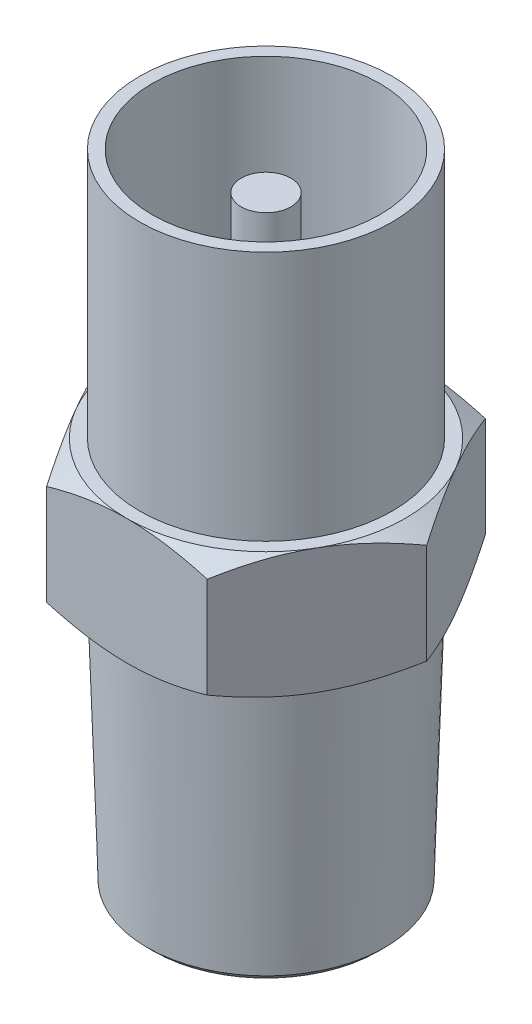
ISO-10303-21;
HEADER;
FILE_DESCRIPTION(('STEP AP214'),'2;1');
FILE_NAME('part.step','',(''),(''),'','','');
FILE_SCHEMA(('AUTOMOTIVE_DESIGN { 1 0 10303 214 1 1 1 1 }'));
ENDSEC;
DATA;
#1=APPLICATION_CONTEXT('core data for automotive mechanical design processes');
#2=APPLICATION_PROTOCOL_DEFINITION('international standard','automotive_design',2000,#1);
#3=PRODUCT_CONTEXT('',#1,'mechanical');
#4=PRODUCT('Part','Part','',(#3));
#5=PRODUCT_RELATED_PRODUCT_CATEGORY('part','',(#4));
#6=PRODUCT_DEFINITION_FORMATION('','',#4);
#7=PRODUCT_DEFINITION_CONTEXT('part definition',#1,'design');
#8=PRODUCT_DEFINITION('design','',#6,#7);
#9=PRODUCT_DEFINITION_SHAPE('','',#8);
#10=(LENGTH_UNIT() NAMED_UNIT(*) SI_UNIT(.MILLI.,.METRE.));
#11=(NAMED_UNIT(*) PLANE_ANGLE_UNIT() SI_UNIT($,.RADIAN.));
#12=(NAMED_UNIT(*) SI_UNIT($,.STERADIAN.) SOLID_ANGLE_UNIT());
#13=UNCERTAINTY_MEASURE_WITH_UNIT(LENGTH_MEASURE(1.E-05),#10,'distance_accuracy_value','');
#14=(GEOMETRIC_REPRESENTATION_CONTEXT(3) GLOBAL_UNCERTAINTY_ASSIGNED_CONTEXT((#13)) GLOBAL_UNIT_ASSIGNED_CONTEXT((#10,
#11,#12)) REPRESENTATION_CONTEXT('',''));
#15=CARTESIAN_POINT('',(0.,0.,0.));
#16=DIRECTION('',(0.,0.,1.));
#17=DIRECTION('',(1.,0.,0.));
#18=AXIS2_PLACEMENT_3D('',#15,#16,#17);
#19=CARTESIAN_POINT('',(0.,2.,0.));
#20=DIRECTION('',(0.,-1.,0.));
#21=DIRECTION('',(0.,0.,-1.));
#22=AXIS2_PLACEMENT_3D('',#19,#20,#21);
#23=CYLINDRICAL_SURFACE('',#22,0.9925);
#24=CARTESIAN_POINT('',(0.,2.,0.));
#25=DIRECTION('',(0.,1.,0.));
#26=DIRECTION('',(0.,0.,1.));
#27=AXIS2_PLACEMENT_3D('',#24,#25,#26);
#28=CIRCLE('',#27,0.9925);
#29=CARTESIAN_POINT('',(0.,2.,0.992499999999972));
#30=VERTEX_POINT('',#29);
#31=EDGE_CURVE('E11',#30,#30,#28,.T.);
#32=ORIENTED_EDGE('',*,*,#31,.F.);
#33=EDGE_LOOP('',(#32));
#34=FACE_BOUND('',#33,.T.);
#35=CARTESIAN_POINT('',(0.,-16.,0.));
#36=DIRECTION('',(0.,1.,0.));
#37=DIRECTION('',(0.,0.,1.));
#38=AXIS2_PLACEMENT_3D('',#35,#36,#37);
#39=CIRCLE('',#38,0.9925);
#40=CARTESIAN_POINT('',(0.,-16.,0.992499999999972));
#41=VERTEX_POINT('',#40);
#42=EDGE_CURVE('E43',#41,#41,#39,.T.);
#43=ORIENTED_EDGE('',*,*,#42,.T.);
#44=EDGE_LOOP('',(#43));
#45=FACE_BOUND('',#44,.T.);
#46=ADVANCED_FACE('F37',(#34,#45),#23,.T.);
#47=CARTESIAN_POINT('',(0.,2.,0.));
#48=DIRECTION('',(0.,1.,0.));
#49=DIRECTION('',(0.,0.,1.));
#50=AXIS2_PLACEMENT_3D('',#47,#48,#49);
#51=PLANE('',#50);
#52=ORIENTED_EDGE('',*,*,#31,.T.);
#53=EDGE_LOOP('',(#52));
#54=FACE_BOUND('',#53,.T.);
#55=ADVANCED_FACE('F52',(#54),#51,.T.);
#56=CARTESIAN_POINT('',(0.,-16.,0.));
#57=DIRECTION('',(0.,1.,0.));
#58=DIRECTION('',(0.,0.,1.));
#59=AXIS2_PLACEMENT_3D('',#56,#57,#58);
#60=PLANE('',#59);
#61=ORIENTED_EDGE('',*,*,#42,.F.);
#62=EDGE_LOOP('',(#61));
#63=FACE_BOUND('',#62,.T.);
#64=ADVANCED_FACE('F50',(#63),#60,.F.);
#65=CLOSED_SHELL('',(#46,#55,#64));
#66=MANIFOLD_SOLID_BREP('B2',#65);
#67=CARTESIAN_POINT('',(6.41436149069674,-6.50000000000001,0.));
#68=DIRECTION('',(0.,-1.,0.));
#69=DIRECTION('',(0.,0.,-1.));
#70=AXIS2_PLACEMENT_3D('',#67,#68,#69);
#71=PLANE('',#70);
#72=CARTESIAN_POINT('',(0.,-6.50000000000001,0.));
#73=DIRECTION('',(0.,-1.,0.));
#74=DIRECTION('',(0.,0.,-1.));
#75=AXIS2_PLACEMENT_3D('',#72,#73,#74);
#76=CIRCLE('',#75,5.555);
#77=CARTESIAN_POINT('',(4.81077111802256,-6.50000000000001,-2.77750000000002));
#78=VERTEX_POINT('',#77);
#79=CARTESIAN_POINT('',(0.,-6.50000000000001,-5.55500000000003));
#80=VERTEX_POINT('',#79);
#81=EDGE_CURVE('E401',#78,#80,#76,.F.);
#82=ORIENTED_EDGE('',*,*,#81,.T.);
#83=CARTESIAN_POINT('',(-4.81077111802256,-6.50000000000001,-2.77750000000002));
#84=VERTEX_POINT('',#83);
#85=EDGE_CURVE('E398',#80,#84,#76,.F.);
#86=ORIENTED_EDGE('',*,*,#85,.T.);
#87=CARTESIAN_POINT('',(-4.81077111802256,-6.50000000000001,2.77749999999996));
#88=VERTEX_POINT('',#87);
#89=EDGE_CURVE('E400',#84,#88,#76,.F.);
#90=ORIENTED_EDGE('',*,*,#89,.T.);
#91=CARTESIAN_POINT('',(0.,-6.50000000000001,5.55499999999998));
#92=VERTEX_POINT('',#91);
#93=EDGE_CURVE('E405',#88,#92,#76,.F.);
#94=ORIENTED_EDGE('',*,*,#93,.T.);
#95=CARTESIAN_POINT('',(0.,-6.50000000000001,0.));
#96=DIRECTION('',(0.,1.,0.));
#97=DIRECTION('',(0.,0.,1.));
#98=AXIS2_PLACEMENT_3D('',#95,#96,#97);
#99=CIRCLE('',#98,5.555);
#100=CARTESIAN_POINT('',(4.81077111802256,-6.50000000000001,2.77749999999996));
#101=VERTEX_POINT('',#100);
#102=EDGE_CURVE('E434',#92,#101,#99,.T.);
#103=ORIENTED_EDGE('',*,*,#102,.T.);
#104=EDGE_CURVE('E407',#101,#78,#76,.F.);
#105=ORIENTED_EDGE('',*,*,#104,.T.);
#106=EDGE_LOOP('',(#82,#86,#90,#94,#103,#105));
#107=FACE_BOUND('',#106,.T.);
#108=CARTESIAN_POINT('',(0.,-6.50000000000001,0.));
#109=DIRECTION('',(0.,-1.,0.));
#110=DIRECTION('',(0.,0.,-1.));
#111=AXIS2_PLACEMENT_3D('',#108,#109,#110);
#112=CIRCLE('',#111,5.04394385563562);
#113=CARTESIAN_POINT('',(0.,-6.50000000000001,-5.04394385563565));
#114=VERTEX_POINT('',#113);
#115=EDGE_CURVE('E35',#114,#114,#112,.F.);
#116=ORIENTED_EDGE('',*,*,#115,.F.);
#117=EDGE_LOOP('',(#116));
#118=FACE_BOUND('',#117,.T.);
#119=ADVANCED_FACE('F72',(#107,#118),#71,.F.);
#120=CARTESIAN_POINT('',(0.,-21.6144278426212,0.));
#121=DIRECTION('',(0.,1.,0.));
#122=DIRECTION('',(0.,0.,1.));
#123=AXIS2_PLACEMENT_3D('',#120,#121,#122);
#124=CYLINDRICAL_SURFACE('',#123,1.985);
#125=CARTESIAN_POINT('',(0.,-16.,0.));
#126=DIRECTION('',(0.,1.,0.));
#127=DIRECTION('',(0.,0.,1.));
#128=AXIS2_PLACEMENT_3D('',#125,#126,#127);
#129=CIRCLE('',#128,1.985);
#130=CARTESIAN_POINT('',(0.,-16.,1.98499999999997));
#131=VERTEX_POINT('',#130);
#132=EDGE_CURVE('E333',#131,#131,#129,.F.);
#133=ORIENTED_EDGE('',*,*,#132,.T.);
#134=EDGE_LOOP('',(#133));
#135=FACE_BOUND('',#134,.T.);
#136=CARTESIAN_POINT('',(0.,-6.50000000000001,0.));
#137=DIRECTION('',(0.,-1.,0.));
#138=DIRECTION('',(0.,0.,-1.));
#139=AXIS2_PLACEMENT_3D('',#136,#137,#138);
#140=CIRCLE('',#139,1.985);
#141=CARTESIAN_POINT('',(0.,-6.50000000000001,-1.98500000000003));
#142=VERTEX_POINT('',#141);
#143=EDGE_CURVE('E346',#142,#142,#140,.F.);
#144=ORIENTED_EDGE('',*,*,#143,.T.);
#145=EDGE_LOOP('',(#144));
#146=FACE_BOUND('',#145,.T.);
#147=ADVANCED_FACE('F310',(#135,#146),#124,.F.);
#148=CARTESIAN_POINT('',(0.,-6.99615258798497,0.));
#149=DIRECTION('',(0.,-1.,0.));
#150=DIRECTION('',(0.,0.,-1.));
#151=AXIS2_PLACEMENT_3D('',#148,#149,#150);
#152=CONICAL_SURFACE('',#151,6.41436149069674,1.0471975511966);
#153=CARTESIAN_POINT('',(6.41447696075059,-6.99621925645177,0.000199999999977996));
#154=CARTESIAN_POINT('',(6.34397930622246,-6.95552307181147,-0.12190551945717));
#155=CARTESIAN_POINT('',(6.27321880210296,-6.91667379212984,-0.244466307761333));
#156=CARTESIAN_POINT('',(6.13112314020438,-6.84317772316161,-0.490583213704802));
#157=CARTESIAN_POINT('',(6.05978774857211,-6.80853274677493,-0.614139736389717));
#158=CARTESIAN_POINT('',(5.84463938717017,-6.71158428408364,-0.986787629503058));
#159=CARTESIAN_POINT('',(5.69997714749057,-6.65644086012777,-1.23734997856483));
#160=CARTESIAN_POINT('',(5.48349273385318,-6.59177825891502,-1.61231198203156));
#161=CARTESIAN_POINT('',(5.41231740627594,-6.57335766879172,-1.73559126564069));
#162=CARTESIAN_POINT('',(5.26964513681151,-6.54246881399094,-1.98270688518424));
#163=CARTESIAN_POINT('',(5.19814822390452,-6.53000002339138,-2.10654317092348));
#164=CARTESIAN_POINT('',(5.05503021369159,-6.5113325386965,-2.35443083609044));
#165=CARTESIAN_POINT('',(4.98340935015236,-6.50512672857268,-2.47848181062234));
#166=CARTESIAN_POINT('',(4.84010540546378,-6.499111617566,-2.72669152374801));
#167=CARTESIAN_POINT('',(4.76842232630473,-6.4993021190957,-2.85085025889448));
#168=CARTESIAN_POINT('',(4.57203130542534,-6.50861630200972,-3.19100948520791));
#169=CARTESIAN_POINT('',(4.44738764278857,-6.52425419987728,-3.40689864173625));
#170=CARTESIAN_POINT('',(4.19892819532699,-6.57384328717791,-3.83724302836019));
#171=CARTESIAN_POINT('',(4.07511328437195,-6.60781142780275,-4.05169674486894));
#172=CARTESIAN_POINT('',(3.82615376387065,-6.69272238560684,-4.48290728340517));
#173=CARTESIAN_POINT('',(3.70104057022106,-6.74402498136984,-4.69960969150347));
#174=CARTESIAN_POINT('',(3.45268003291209,-6.86046135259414,-5.12978276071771));
#175=CARTESIAN_POINT('',(3.32942950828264,-6.92556777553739,-5.34325893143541));
#176=CARTESIAN_POINT('',(3.20706527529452,-6.99621925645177,-5.55520000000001));
#177=B_SPLINE_CURVE_WITH_KNOTS('',3,(#153,#154,#155,#156,#157,#158,#159,#160,#161,#162,#163,
#164,#165,#166,#167,#168,#169,#170,#171,#172,#173,#174,#175,#176),.UNSPECIFIED.,.F.,.F.,(4,2,2,
2,2,2,2,2,2,2,2,4),(0.,0.44021785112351,0.880624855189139,1.76326895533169,2.19378108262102,
2.62425516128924,3.05423958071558,3.48421071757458,4.23275721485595,4.98199713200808,
5.7478547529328,6.51220876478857),.UNSPECIFIED.);
#178=CARTESIAN_POINT('',(3.20718074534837,-6.99615258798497,-5.555));
#179=VERTEX_POINT('',#178);
#180=EDGE_CURVE('E264',#78,#179,#177,.T.);
#181=ORIENTED_EDGE('',*,*,#180,.T.);
#182=CARTESIAN_POINT('',(-8.50591597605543,-9.15821584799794,-5.55500000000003));
#183=CARTESIAN_POINT('',(-8.26202006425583,-9.04035187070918,-5.55500000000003));
#184=CARTESIAN_POINT('',(-8.01754750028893,-8.92365955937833,-5.55500000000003));
#185=CARTESIAN_POINT('',(-7.52713727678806,-8.69328779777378,-5.55500000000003));
#186=CARTESIAN_POINT('',(-7.2811993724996,-8.57960886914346,-5.55500000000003));
#187=CARTESIAN_POINT('',(-6.78621814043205,-8.35533453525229,-5.55500000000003));
#188=CARTESIAN_POINT('',(-6.53716509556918,-8.24476049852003,-5.55500000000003));
#189=CARTESIAN_POINT('',(-6.03701199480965,-8.02836185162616,-5.55500000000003));
#190=CARTESIAN_POINT('',(-5.78591204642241,-7.92253699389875,-5.55500000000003));
#191=CARTESIAN_POINT('',(-5.27814862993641,-7.71564321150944,-5.55500000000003));
#192=CARTESIAN_POINT('',(-5.02145470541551,-7.61464862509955,-5.55500000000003));
#193=CARTESIAN_POINT('',(-4.5050389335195,-7.42056938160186,-5.55500000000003));
#194=CARTESIAN_POINT('',(-4.24531675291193,-7.3274856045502,-5.55500000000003));
#195=CARTESIAN_POINT('',(-3.72296562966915,-7.15172885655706,-5.55500000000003));
#196=CARTESIAN_POINT('',(-3.46034420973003,-7.06903375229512,-5.55500000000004));
#197=CARTESIAN_POINT('',(-2.93136514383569,-6.91674098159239,-5.55500000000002));
#198=CARTESIAN_POINT('',(-2.66500870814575,-6.84713917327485,-5.555));
#199=CARTESIAN_POINT('',(-2.12839051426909,-6.72440839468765,-5.555));
#200=CARTESIAN_POINT('',(-1.85812773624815,-6.67128381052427,-5.55500000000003));
#201=CARTESIAN_POINT('',(-1.31430588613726,-6.58509766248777,-5.55500000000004));
#202=CARTESIAN_POINT('',(-1.04074681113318,-6.55203611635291,-5.55500000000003));
#203=CARTESIAN_POINT('',(-0.629972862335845,-6.51961048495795,-5.55500000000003));
#204=CARTESIAN_POINT('',(-0.493400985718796,-6.51166141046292,-5.55500000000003));
#205=CARTESIAN_POINT('',(-0.220036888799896,-6.50155034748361,-5.55500000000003));
#206=CARTESIAN_POINT('',(-0.0832446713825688,-6.49938828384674,-5.55500000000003));
#207=CARTESIAN_POINT('',(0.190267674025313,-6.50090932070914,-5.55500000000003));
#208=CARTESIAN_POINT('',(0.326987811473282,-6.50459078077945,-5.55500000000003));
#209=CARTESIAN_POINT('',(0.600154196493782,-6.51770556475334,-5.55500000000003));
#210=CARTESIAN_POINT('',(0.736600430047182,-6.5271391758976,-5.55500000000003));
#211=CARTESIAN_POINT('',(1.06730397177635,-6.55677796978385,-5.55500000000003));
#212=CARTESIAN_POINT('',(1.26130714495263,-6.57986541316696,-5.55500000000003));
#213=CARTESIAN_POINT('',(1.64782691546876,-6.63638797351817,-5.55500000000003));
#214=CARTESIAN_POINT('',(1.84034309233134,-6.66982591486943,-5.55500000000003));
#215=CARTESIAN_POINT('',(2.22372997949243,-6.74586359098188,-5.55500000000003));
#216=CARTESIAN_POINT('',(2.41459895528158,-6.78847198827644,-5.55500000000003));
#217=CARTESIAN_POINT('',(2.79437314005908,-6.88155052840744,-5.55500000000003));
#218=CARTESIAN_POINT('',(2.9832785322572,-6.93201993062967,-5.55500000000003));
#219=CARTESIAN_POINT('',(3.36377824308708,-7.04093232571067,-5.55500000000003));
#220=CARTESIAN_POINT('',(3.55532497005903,-7.0995404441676,-5.55500000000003));
#221=CARTESIAN_POINT('',(3.93639377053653,-7.22254750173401,-5.55500000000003));
#222=CARTESIAN_POINT('',(4.12591714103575,-7.28694244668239,-5.55500000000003));
#223=CARTESIAN_POINT('',(4.50217874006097,-7.42019301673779,-5.55500000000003));
#224=CARTESIAN_POINT('',(4.68892664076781,-7.48902149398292,-5.55500000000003));
#225=CARTESIAN_POINT('',(5.06097353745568,-7.63071828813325,-5.55500000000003));
#226=CARTESIAN_POINT('',(5.24627191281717,-7.70358823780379,-5.55500000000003));
#227=CARTESIAN_POINT('',(5.43089711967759,-7.77807913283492,-5.55500000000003));
#228=B_SPLINE_CURVE_WITH_KNOTS('',3,(#182,#183,#184,#185,#186,#187,#188,#189,#190,#191,#192,
#193,#194,#195,#196,#197,#198,#199,#200,#201,#202,#203,#204,#205,#206,#207,#208,#209,#210,#211,
#212,#213,#214,#215,#216,#217,#218,#219,#220,#221,#222,#223,#224,#225,#226,#227),.UNSPECIFIED.,
.F.,.F.,(4,2,2,2,2,2,2,2,2,2,2,2,2,2,2,2,2,2,2,2,2,2,4),(0.,0.812657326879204,1.62545442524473,
2.44290283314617,3.26030857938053,4.08774953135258,4.91528241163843,5.74102118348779,
6.56649830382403,7.39219497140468,8.21789236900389,8.6281972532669,9.03849680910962,
9.44868120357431,9.85888608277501,10.4446760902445,11.0306260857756,11.617132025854,
12.2035827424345,12.8044086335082,13.4048229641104,14.0018577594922,14.5991355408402),.UNSPECIFIED.);
#229=EDGE_CURVE('E265',#179,#80,#228,.F.);
#230=ORIENTED_EDGE('',*,*,#229,.T.);
#231=ORIENTED_EDGE('',*,*,#81,.F.);
#232=EDGE_LOOP('',(#181,#230,#231));
#233=FACE_BOUND('',#232,.T.);
#234=ADVANCED_FACE('F315',(#233),#152,.T.);
#235=CARTESIAN_POINT('',(3.20706527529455,-6.99621925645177,5.55520000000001));
#236=CARTESIAN_POINT('',(3.27756292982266,-6.95552307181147,5.43309448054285));
#237=CARTESIAN_POINT('',(3.34832343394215,-6.91667379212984,5.31053369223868));
#238=CARTESIAN_POINT('',(3.49041909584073,-6.84317772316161,5.06441678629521));
#239=CARTESIAN_POINT('',(3.561754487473,-6.80853274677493,4.94086026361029));
#240=CARTESIAN_POINT('',(3.77690284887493,-6.71158428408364,4.56821237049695));
#241=CARTESIAN_POINT('',(3.92156508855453,-6.65644086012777,4.31765002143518));
#242=CARTESIAN_POINT('',(4.13804950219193,-6.59177825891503,3.94268801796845));
#243=CARTESIAN_POINT('',(4.20922482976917,-6.57335766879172,3.81940873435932));
#244=CARTESIAN_POINT('',(4.35189709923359,-6.54246881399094,3.57229311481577));
#245=CARTESIAN_POINT('',(4.42339401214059,-6.53000002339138,3.44845682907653));
#246=CARTESIAN_POINT('',(4.56651202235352,-6.5113325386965,3.20056916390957));
#247=CARTESIAN_POINT('',(4.63813288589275,-6.50512672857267,3.07651818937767));
#248=CARTESIAN_POINT('',(4.78143683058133,-6.49911161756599,2.828308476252));
#249=CARTESIAN_POINT('',(4.85311990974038,-6.4993021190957,2.70414974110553));
#250=CARTESIAN_POINT('',(5.04951093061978,-6.50861630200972,2.36399051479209));
#251=CARTESIAN_POINT('',(5.17415459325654,-6.52425419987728,2.14810135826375));
#252=CARTESIAN_POINT('',(5.42261404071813,-6.57384328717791,1.71775697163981));
#253=CARTESIAN_POINT('',(5.54642895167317,-6.60781142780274,1.50330325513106));
#254=CARTESIAN_POINT('',(5.79538847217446,-6.69272238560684,1.07209271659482));
#255=CARTESIAN_POINT('',(5.92050166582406,-6.74402498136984,0.855390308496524));
#256=CARTESIAN_POINT('',(6.16886220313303,-6.86046135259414,0.425217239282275));
#257=CARTESIAN_POINT('',(6.29211272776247,-6.9255677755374,0.211741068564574));
#258=CARTESIAN_POINT('',(6.41447696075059,-6.99621925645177,-0.000200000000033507));
#259=B_SPLINE_CURVE_WITH_KNOTS('',3,(#235,#236,#237,#238,#239,#240,#241,#242,#243,#244,#245,
#246,#247,#248,#249,#250,#251,#252,#253,#254,#255,#256,#257,#258),.UNSPECIFIED.,.F.,.F.,(4,2,2,
2,2,2,2,2,2,2,2,4),(0.,0.440217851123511,0.880624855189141,1.76326895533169,2.19378108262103,
2.62425516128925,3.05423958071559,3.48421071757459,4.23275721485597,4.9819971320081,
5.74785475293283,6.5122087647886),.UNSPECIFIED.);
#260=CARTESIAN_POINT('',(6.41436149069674,-6.99615258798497,0.));
#261=VERTEX_POINT('',#260);
#262=EDGE_CURVE('E282',#101,#261,#259,.T.);
#263=ORIENTED_EDGE('',*,*,#262,.T.);
#264=EDGE_CURVE('E276',#261,#78,#177,.T.);
#265=ORIENTED_EDGE('',*,*,#264,.T.);
#266=ORIENTED_EDGE('',*,*,#104,.F.);
#267=EDGE_LOOP('',(#263,#265,#266));
#268=FACE_BOUND('',#267,.T.);
#269=ADVANCED_FACE('F466',(#268),#152,.T.);
#270=CARTESIAN_POINT('',(-8.50591597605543,-9.15821584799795,5.55499999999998));
#271=CARTESIAN_POINT('',(-8.26202006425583,-9.04035187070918,5.55499999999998));
#272=CARTESIAN_POINT('',(-8.01754750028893,-8.92365955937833,5.55499999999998));
#273=CARTESIAN_POINT('',(-7.52713727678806,-8.69328779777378,5.55499999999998));
#274=CARTESIAN_POINT('',(-7.2811993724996,-8.57960886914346,5.55499999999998));
#275=CARTESIAN_POINT('',(-6.78621814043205,-8.35533453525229,5.55499999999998));
#276=CARTESIAN_POINT('',(-6.53716509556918,-8.24476049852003,5.55499999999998));
#277=CARTESIAN_POINT('',(-6.03701199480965,-8.02836185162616,5.55499999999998));
#278=CARTESIAN_POINT('',(-5.78591204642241,-7.92253699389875,5.55499999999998));
#279=CARTESIAN_POINT('',(-5.27814862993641,-7.71564321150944,5.55499999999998));
#280=CARTESIAN_POINT('',(-5.02145470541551,-7.61464862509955,5.55499999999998));
#281=CARTESIAN_POINT('',(-4.5050389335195,-7.42056938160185,5.55499999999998));
#282=CARTESIAN_POINT('',(-4.24531675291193,-7.32748560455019,5.55499999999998));
#283=CARTESIAN_POINT('',(-3.72296562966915,-7.15172885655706,5.55499999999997));
#284=CARTESIAN_POINT('',(-3.46034420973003,-7.06903375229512,5.55499999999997));
#285=CARTESIAN_POINT('',(-2.93136514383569,-6.91674098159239,5.55499999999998));
#286=CARTESIAN_POINT('',(-2.66500870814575,-6.84713917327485,5.555));
#287=CARTESIAN_POINT('',(-2.12839051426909,-6.72440839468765,5.555));
#288=CARTESIAN_POINT('',(-1.85812773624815,-6.67128381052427,5.55499999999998));
#289=CARTESIAN_POINT('',(-1.31430588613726,-6.58509766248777,5.55499999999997));
#290=CARTESIAN_POINT('',(-1.04074681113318,-6.55203611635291,5.55499999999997));
#291=CARTESIAN_POINT('',(-0.629972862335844,-6.51961048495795,5.55499999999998));
#292=CARTESIAN_POINT('',(-0.493400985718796,-6.51166141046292,5.55499999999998));
#293=CARTESIAN_POINT('',(-0.220036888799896,-6.50155034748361,5.55499999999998));
#294=CARTESIAN_POINT('',(-0.0832446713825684,-6.49938828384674,5.55499999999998));
#295=CARTESIAN_POINT('',(0.190267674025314,-6.50090932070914,5.55499999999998));
#296=CARTESIAN_POINT('',(0.326987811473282,-6.50459078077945,5.55499999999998));
#297=CARTESIAN_POINT('',(0.600154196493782,-6.51770556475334,5.55499999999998));
#298=CARTESIAN_POINT('',(0.736600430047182,-6.5271391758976,5.55499999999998));
#299=CARTESIAN_POINT('',(1.06730397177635,-6.55677796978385,5.55499999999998));
#300=CARTESIAN_POINT('',(1.26130714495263,-6.57986541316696,5.55499999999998));
#301=CARTESIAN_POINT('',(1.64782691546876,-6.63638797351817,5.55499999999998));
#302=CARTESIAN_POINT('',(1.84034309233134,-6.66982591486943,5.55499999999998));
#303=CARTESIAN_POINT('',(2.22372997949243,-6.74586359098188,5.55499999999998));
#304=CARTESIAN_POINT('',(2.41459895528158,-6.78847198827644,5.55499999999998));
#305=CARTESIAN_POINT('',(2.79437314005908,-6.88155052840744,5.55499999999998));
#306=CARTESIAN_POINT('',(2.9832785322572,-6.93201993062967,5.55499999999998));
#307=CARTESIAN_POINT('',(3.36377824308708,-7.04093232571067,5.55499999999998));
#308=CARTESIAN_POINT('',(3.55532497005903,-7.0995404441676,5.55499999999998));
#309=CARTESIAN_POINT('',(3.93639377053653,-7.22254750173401,5.55499999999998));
#310=CARTESIAN_POINT('',(4.12591714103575,-7.28694244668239,5.55499999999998));
#311=CARTESIAN_POINT('',(4.50217874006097,-7.42019301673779,5.55499999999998));
#312=CARTESIAN_POINT('',(4.68892664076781,-7.48902149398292,5.55499999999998));
#313=CARTESIAN_POINT('',(5.06097353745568,-7.63071828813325,5.55499999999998));
#314=CARTESIAN_POINT('',(5.24627191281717,-7.70358823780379,5.55499999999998));
#315=CARTESIAN_POINT('',(5.43089711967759,-7.77807913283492,5.55499999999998));
#316=B_SPLINE_CURVE_WITH_KNOTS('',3,(#270,#271,#272,#273,#274,#275,#276,#277,#278,#279,#280,
#281,#282,#283,#284,#285,#286,#287,#288,#289,#290,#291,#292,#293,#294,#295,#296,#297,#298,#299,
#300,#301,#302,#303,#304,#305,#306,#307,#308,#309,#310,#311,#312,#313,#314,#315),.UNSPECIFIED.,
.F.,.F.,(4,2,2,2,2,2,2,2,2,2,2,2,2,2,2,2,2,2,2,2,2,2,4),(0.,0.812657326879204,1.62545442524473,
2.44290283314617,3.26030857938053,4.08774953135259,4.91528241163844,5.74102118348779,
6.56649830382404,7.39219497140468,8.21789236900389,8.6281972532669,9.03849680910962,
9.44868120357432,9.85888608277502,10.4446760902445,11.0306260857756,11.617132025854,
12.2035827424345,12.8044086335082,13.4048229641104,14.0018577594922,14.5991355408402),.UNSPECIFIED.);
#317=CARTESIAN_POINT('',(3.20718074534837,-6.99615258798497,5.555));
#318=VERTEX_POINT('',#317);
#319=EDGE_CURVE('E290',#92,#318,#316,.T.);
#320=ORIENTED_EDGE('',*,*,#319,.T.);
#321=EDGE_CURVE('E289',#318,#101,#259,.T.);
#322=ORIENTED_EDGE('',*,*,#321,.T.);
#323=ORIENTED_EDGE('',*,*,#102,.F.);
#324=EDGE_LOOP('',(#320,#322,#323));
#325=FACE_BOUND('',#324,.T.);
#326=ADVANCED_FACE('F435',(#325),#152,.T.);
#327=CARTESIAN_POINT('',(-3.20718074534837,-6.99615258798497,5.55499999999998));
#328=VERTEX_POINT('',#327);
#329=EDGE_CURVE('E296',#328,#92,#316,.T.);
#330=ORIENTED_EDGE('',*,*,#329,.T.);
#331=ORIENTED_EDGE('',*,*,#93,.F.);
#332=CARTESIAN_POINT('',(-6.41447696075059,-6.99621925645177,-0.000200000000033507));
#333=CARTESIAN_POINT('',(-6.34397930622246,-6.95552307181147,0.121905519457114));
#334=CARTESIAN_POINT('',(-6.27321880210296,-6.91667379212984,0.244466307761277));
#335=CARTESIAN_POINT('',(-6.13112314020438,-6.84317772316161,0.490583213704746));
#336=CARTESIAN_POINT('',(-6.05978774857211,-6.80853274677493,0.614139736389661));
#337=CARTESIAN_POINT('',(-5.84463938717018,-6.71158428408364,0.986787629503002));
#338=CARTESIAN_POINT('',(-5.69997714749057,-6.65644086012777,1.23734997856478));
#339=CARTESIAN_POINT('',(-5.48349273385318,-6.59177825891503,1.6123119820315));
#340=CARTESIAN_POINT('',(-5.41231740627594,-6.57335766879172,1.73559126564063));
#341=CARTESIAN_POINT('',(-5.26964513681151,-6.54246881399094,1.98270688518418));
#342=CARTESIAN_POINT('',(-5.19814822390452,-6.53000002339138,2.10654317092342));
#343=CARTESIAN_POINT('',(-5.05503021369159,-6.51133253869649,2.35443083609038));
#344=CARTESIAN_POINT('',(-4.98340935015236,-6.50512672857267,2.47848181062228));
#345=CARTESIAN_POINT('',(-4.84010540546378,-6.49911161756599,2.72669152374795));
#346=CARTESIAN_POINT('',(-4.76842232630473,-6.4993021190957,2.85085025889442));
#347=CARTESIAN_POINT('',(-4.57203130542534,-6.50861630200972,3.19100948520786));
#348=CARTESIAN_POINT('',(-4.44738764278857,-6.52425419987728,3.40689864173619));
#349=CARTESIAN_POINT('',(-4.19892819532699,-6.57384328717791,3.83724302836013));
#350=CARTESIAN_POINT('',(-4.07511328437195,-6.60781142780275,4.05169674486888));
#351=CARTESIAN_POINT('',(-3.82615376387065,-6.69272238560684,4.48290728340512));
#352=CARTESIAN_POINT('',(-3.70104057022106,-6.74402498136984,4.69960969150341));
#353=CARTESIAN_POINT('',(-3.45268003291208,-6.86046135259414,5.12978276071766));
#354=CARTESIAN_POINT('',(-3.32942950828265,-6.9255677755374,5.34325893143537));
#355=CARTESIAN_POINT('',(-3.20706527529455,-6.99621925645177,5.55519999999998));
#356=B_SPLINE_CURVE_WITH_KNOTS('',3,(#332,#333,#334,#335,#336,#337,#338,#339,#340,#341,#342,
#343,#344,#345,#346,#347,#348,#349,#350,#351,#352,#353,#354,#355),.UNSPECIFIED.,.F.,.F.,(4,2,2,
2,2,2,2,2,2,2,2,4),(0.,0.440217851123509,0.880624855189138,1.76326895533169,2.19378108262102,
2.62425516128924,3.05423958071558,3.48421071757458,4.23275721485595,4.98199713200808,
5.74785475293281,6.51220876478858),.UNSPECIFIED.);
#357=EDGE_CURVE('E283',#88,#328,#356,.T.);
#358=ORIENTED_EDGE('',*,*,#357,.T.);
#359=EDGE_LOOP('',(#330,#331,#358));
#360=FACE_BOUND('',#359,.T.);
#361=ADVANCED_FACE('F428',(#360),#152,.T.);
#362=CARTESIAN_POINT('',(-6.41436149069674,-6.99615258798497,0.));
#363=VERTEX_POINT('',#362);
#364=EDGE_CURVE('E277',#363,#88,#356,.T.);
#365=ORIENTED_EDGE('',*,*,#364,.T.);
#366=ORIENTED_EDGE('',*,*,#89,.F.);
#367=CARTESIAN_POINT('',(-3.20706527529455,-6.99621925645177,-5.55520000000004));
#368=CARTESIAN_POINT('',(-3.27756292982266,-6.95552307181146,-5.43309448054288));
#369=CARTESIAN_POINT('',(-3.34832343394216,-6.91667379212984,-5.31053369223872));
#370=CARTESIAN_POINT('',(-3.49041909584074,-6.84317772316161,-5.06441678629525));
#371=CARTESIAN_POINT('',(-3.56175448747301,-6.80853274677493,-4.94086026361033));
#372=CARTESIAN_POINT('',(-3.77690284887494,-6.71158428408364,-4.56821237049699));
#373=CARTESIAN_POINT('',(-3.92156508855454,-6.65644086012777,-4.31765002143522));
#374=CARTESIAN_POINT('',(-4.13804950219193,-6.59177825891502,-3.9426880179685));
#375=CARTESIAN_POINT('',(-4.20922482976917,-6.57335766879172,-3.81940873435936));
#376=CARTESIAN_POINT('',(-4.3518970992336,-6.54246881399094,-3.57229311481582));
#377=CARTESIAN_POINT('',(-4.42339401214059,-6.53000002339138,-3.44845682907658));
#378=CARTESIAN_POINT('',(-4.56651202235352,-6.51133253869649,-3.20056916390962));
#379=CARTESIAN_POINT('',(-4.63813288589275,-6.50512672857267,-3.07651818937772));
#380=CARTESIAN_POINT('',(-4.78143683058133,-6.49911161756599,-2.82830847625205));
#381=CARTESIAN_POINT('',(-4.85311990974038,-6.4993021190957,-2.70414974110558));
#382=CARTESIAN_POINT('',(-5.04951093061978,-6.50861630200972,-2.36399051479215));
#383=CARTESIAN_POINT('',(-5.17415459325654,-6.52425419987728,-2.14810135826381));
#384=CARTESIAN_POINT('',(-5.42261404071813,-6.57384328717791,-1.71775697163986));
#385=CARTESIAN_POINT('',(-5.54642895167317,-6.60781142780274,-1.50330325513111));
#386=CARTESIAN_POINT('',(-5.79538847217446,-6.69272238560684,-1.07209271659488));
#387=CARTESIAN_POINT('',(-5.92050166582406,-6.74402498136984,-0.855390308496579));
#388=CARTESIAN_POINT('',(-6.16886220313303,-6.86046135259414,-0.42521723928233));
#389=CARTESIAN_POINT('',(-6.29211272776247,-6.9255677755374,-0.211741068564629));
#390=CARTESIAN_POINT('',(-6.41447696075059,-6.99621925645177,0.000199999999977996));
#391=B_SPLINE_CURVE_WITH_KNOTS('',3,(#367,#368,#369,#370,#371,#372,#373,#374,#375,#376,#377,
#378,#379,#380,#381,#382,#383,#384,#385,#386,#387,#388,#389,#390),.UNSPECIFIED.,.F.,.F.,(4,2,2,
2,2,2,2,2,2,2,2,4),(0.,0.440217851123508,0.880624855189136,1.76326895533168,2.19378108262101,
2.62425516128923,3.05423958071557,3.48421071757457,4.23275721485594,4.98199713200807,
5.74785475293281,6.51220876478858),.UNSPECIFIED.);
#392=EDGE_CURVE('E266',#84,#363,#391,.T.);
#393=ORIENTED_EDGE('',*,*,#392,.T.);
#394=EDGE_LOOP('',(#365,#366,#393));
#395=FACE_BOUND('',#394,.T.);
#396=ADVANCED_FACE('F461',(#395),#152,.T.);
#397=CARTESIAN_POINT('',(-3.20718074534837,-6.99615258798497,-5.55500000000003));
#398=VERTEX_POINT('',#397);
#399=EDGE_CURVE('E258',#398,#84,#391,.T.);
#400=ORIENTED_EDGE('',*,*,#399,.T.);
#401=ORIENTED_EDGE('',*,*,#85,.F.);
#402=EDGE_CURVE('E267',#80,#398,#228,.F.);
#403=ORIENTED_EDGE('',*,*,#402,.T.);
#404=EDGE_LOOP('',(#400,#401,#403));
#405=FACE_BOUND('',#404,.T.);
#406=ADVANCED_FACE('F217',(#405),#152,.T.);
#407=CARTESIAN_POINT('',(3.20718074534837,-28.4708053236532,-5.55500000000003));
#408=DIRECTION('',(0.,0.,-1.));
#409=DIRECTION('',(-1.,0.,0.));
#410=AXIS2_PLACEMENT_3D('',#407,#408,#409);
#411=PLANE('',#410);
#412=CARTESIAN_POINT('',(-8.50591597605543,-8.84178415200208,-5.55500000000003));
#413=CARTESIAN_POINT('',(-8.26202006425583,-8.95964812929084,-5.55500000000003));
#414=CARTESIAN_POINT('',(-8.01754750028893,-9.07634044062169,-5.55500000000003));
#415=CARTESIAN_POINT('',(-7.52713727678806,-9.30671220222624,-5.55500000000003));
#416=CARTESIAN_POINT('',(-7.2811993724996,-9.42039113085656,-5.55500000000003));
#417=CARTESIAN_POINT('',(-6.78621814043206,-9.64466546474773,-5.55500000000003));
#418=CARTESIAN_POINT('',(-6.53716509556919,-9.75523950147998,-5.55500000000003));
#419=CARTESIAN_POINT('',(-6.03701199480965,-9.97163814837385,-5.55500000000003));
#420=CARTESIAN_POINT('',(-5.78591204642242,-10.0774630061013,-5.55500000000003));
#421=CARTESIAN_POINT('',(-5.27814862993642,-10.2843567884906,-5.55500000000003));
#422=CARTESIAN_POINT('',(-5.02145470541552,-10.3853513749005,-5.55500000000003));
#423=CARTESIAN_POINT('',(-4.50503893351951,-10.5794306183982,-5.55500000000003));
#424=CARTESIAN_POINT('',(-4.24531675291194,-10.6725143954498,-5.55500000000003));
#425=CARTESIAN_POINT('',(-3.72296562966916,-10.848271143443,-5.55500000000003));
#426=CARTESIAN_POINT('',(-3.46034420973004,-10.9309662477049,-5.55500000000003));
#427=CARTESIAN_POINT('',(-2.93136514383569,-11.0832590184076,-5.55500000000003));
#428=CARTESIAN_POINT('',(-2.66500870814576,-11.1528608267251,-5.55500000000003));
#429=CARTESIAN_POINT('',(-2.12839051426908,-11.2755916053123,-5.55500000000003));
#430=CARTESIAN_POINT('',(-1.85812773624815,-11.3287161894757,-5.55500000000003));
#431=CARTESIAN_POINT('',(-1.31430588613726,-11.4149023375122,-5.55500000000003));
#432=CARTESIAN_POINT('',(-1.04074681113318,-11.4479638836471,-5.55500000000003));
#433=CARTESIAN_POINT('',(-0.629972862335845,-11.4803895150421,-5.55500000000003));
#434=CARTESIAN_POINT('',(-0.493400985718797,-11.4883385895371,-5.55500000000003));
#435=CARTESIAN_POINT('',(-0.220036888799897,-11.4984496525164,-5.55500000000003));
#436=CARTESIAN_POINT('',(-0.0832446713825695,-11.5006117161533,-5.55500000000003));
#437=CARTESIAN_POINT('',(0.190267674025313,-11.4990906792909,-5.55500000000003));
#438=CARTESIAN_POINT('',(0.326987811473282,-11.4954092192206,-5.55500000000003));
#439=CARTESIAN_POINT('',(0.600154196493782,-11.4822944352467,-5.55500000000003));
#440=CARTESIAN_POINT('',(0.736600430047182,-11.4728608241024,-5.55500000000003));
#441=CARTESIAN_POINT('',(1.06730397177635,-11.4432220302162,-5.55500000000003));
#442=CARTESIAN_POINT('',(1.26130714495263,-11.420134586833,-5.55500000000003));
#443=CARTESIAN_POINT('',(1.64782691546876,-11.3636120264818,-5.55500000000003));
#444=CARTESIAN_POINT('',(1.84034309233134,-11.3301740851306,-5.55500000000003));
#445=CARTESIAN_POINT('',(2.22372997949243,-11.2541364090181,-5.55500000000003));
#446=CARTESIAN_POINT('',(2.41459895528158,-11.2115280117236,-5.55500000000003));
#447=CARTESIAN_POINT('',(2.79437314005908,-11.1184494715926,-5.55500000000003));
#448=CARTESIAN_POINT('',(2.9832785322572,-11.0679800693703,-5.55500000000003));
#449=CARTESIAN_POINT('',(3.36377824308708,-10.9590676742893,-5.55500000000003));
#450=CARTESIAN_POINT('',(3.55532497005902,-10.9004595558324,-5.55500000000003));
#451=CARTESIAN_POINT('',(3.93639377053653,-10.777452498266,-5.55500000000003));
#452=CARTESIAN_POINT('',(4.12591714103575,-10.7130575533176,-5.55500000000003));
#453=CARTESIAN_POINT('',(4.50217874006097,-10.5798069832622,-5.55500000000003));
#454=CARTESIAN_POINT('',(4.68892664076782,-10.5109785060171,-5.55500000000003));
#455=CARTESIAN_POINT('',(5.06097353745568,-10.3692817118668,-5.55500000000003));
#456=CARTESIAN_POINT('',(5.24627191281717,-10.2964117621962,-5.55500000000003));
#457=CARTESIAN_POINT('',(5.43089711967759,-10.2219208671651,-5.55500000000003));
#458=B_SPLINE_CURVE_WITH_KNOTS('',3,(#412,#413,#414,#415,#416,#417,#418,#419,#420,#421,#422,
#423,#424,#425,#426,#427,#428,#429,#430,#431,#432,#433,#434,#435,#436,#437,#438,#439,#440,#441,
#442,#443,#444,#445,#446,#447,#448,#449,#450,#451,#452,#453,#454,#455,#456,#457),.UNSPECIFIED.,
.F.,.F.,(4,2,2,2,2,2,2,2,2,2,2,2,2,2,2,2,2,2,2,2,2,2,4),(0.,0.812657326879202,1.62545442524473,
2.44290283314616,3.26030857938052,4.08774953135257,4.91528241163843,5.74102118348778,
6.56649830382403,7.39219497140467,8.21789236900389,8.62819725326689,9.03849680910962,
9.44868120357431,9.85888608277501,10.4446760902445,11.0306260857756,11.617132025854,
12.2035827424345,12.8044086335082,13.4048229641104,14.0018577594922,14.5991355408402),.UNSPECIFIED.);
#459=CARTESIAN_POINT('',(-3.20718074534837,-11.003847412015,-5.55500000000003));
#460=VERTEX_POINT('',#459);
#461=CARTESIAN_POINT('',(0.,-11.5,-5.55500000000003));
#462=VERTEX_POINT('',#461);
#463=EDGE_CURVE('E189',#460,#462,#458,.T.);
#464=ORIENTED_EDGE('',*,*,#463,.F.);
#465=DIRECTION('',(0.,1.,0.));
#466=VECTOR('',#465,1.);
#467=CARTESIAN_POINT('',(-3.20718074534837,-28.4708053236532,-5.55500000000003));
#468=LINE('',#467,#466);
#469=EDGE_CURVE('E418',#460,#398,#468,.T.);
#470=ORIENTED_EDGE('',*,*,#469,.T.);
#471=ORIENTED_EDGE('',*,*,#402,.F.);
#472=ORIENTED_EDGE('',*,*,#229,.F.);
#473=DIRECTION('',(0.,1.,0.));
#474=VECTOR('',#473,1.);
#475=CARTESIAN_POINT('',(3.20718074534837,-28.4708053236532,-5.55500000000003));
#476=LINE('',#475,#474);
#477=CARTESIAN_POINT('',(3.20718074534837,-11.003847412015,-5.555));
#478=VERTEX_POINT('',#477);
#479=EDGE_CURVE('E419',#478,#179,#476,.T.);
#480=ORIENTED_EDGE('',*,*,#479,.F.);
#481=EDGE_CURVE('E183',#462,#478,#458,.T.);
#482=ORIENTED_EDGE('',*,*,#481,.F.);
#483=EDGE_LOOP('',(#464,#470,#471,#472,#480,#482));
#484=FACE_BOUND('',#483,.T.);
#485=ADVANCED_FACE('F252',(#484),#411,.T.);
#486=CARTESIAN_POINT('',(-3.20718074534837,-28.4708053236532,-5.55500000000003));
#487=DIRECTION('',(-0.86602540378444,0.,-0.5));
#488=DIRECTION('',(-0.500000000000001,0.,0.866025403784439));
#489=AXIS2_PLACEMENT_3D('',#486,#487,#488);
#490=PLANE('',#489);
#491=CARTESIAN_POINT('',(-6.41447696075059,-11.0037807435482,0.000199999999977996));
#492=CARTESIAN_POINT('',(-6.34397930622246,-11.0444769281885,-0.121905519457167));
#493=CARTESIAN_POINT('',(-6.27321880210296,-11.0833262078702,-0.24446630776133));
#494=CARTESIAN_POINT('',(-6.13112314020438,-11.1568222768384,-0.490583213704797));
#495=CARTESIAN_POINT('',(-6.05978774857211,-11.1914672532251,-0.614139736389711));
#496=CARTESIAN_POINT('',(-5.84463938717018,-11.2884157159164,-0.98678762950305));
#497=CARTESIAN_POINT('',(-5.69997714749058,-11.3435591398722,-1.23734997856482));
#498=CARTESIAN_POINT('',(-5.48349273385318,-11.408221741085,-1.61231198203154));
#499=CARTESIAN_POINT('',(-5.41231740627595,-11.4266423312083,-1.73559126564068));
#500=CARTESIAN_POINT('',(-5.26964513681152,-11.4575311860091,-1.98270688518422));
#501=CARTESIAN_POINT('',(-5.19814822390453,-11.4699999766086,-2.10654317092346));
#502=CARTESIAN_POINT('',(-5.0550302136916,-11.4886674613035,-2.35443083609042));
#503=CARTESIAN_POINT('',(-4.98340935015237,-11.4948732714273,-2.47848181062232));
#504=CARTESIAN_POINT('',(-4.84010540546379,-11.500888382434,-2.72669152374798));
#505=CARTESIAN_POINT('',(-4.76842232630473,-11.5006978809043,-2.85085025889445));
#506=CARTESIAN_POINT('',(-4.57203130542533,-11.4913836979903,-3.19100948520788));
#507=CARTESIAN_POINT('',(-4.44738764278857,-11.4757458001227,-3.40689864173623));
#508=CARTESIAN_POINT('',(-4.198928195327,-11.4261567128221,-3.83724302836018));
#509=CARTESIAN_POINT('',(-4.07511328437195,-11.3921885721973,-4.05169674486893));
#510=CARTESIAN_POINT('',(-3.82615376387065,-11.3072776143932,-4.48290728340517));
#511=CARTESIAN_POINT('',(-3.70104057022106,-11.2559750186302,-4.69960969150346));
#512=CARTESIAN_POINT('',(-3.45268003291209,-11.1395386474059,-5.12978276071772));
#513=CARTESIAN_POINT('',(-3.32942950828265,-11.0744322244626,-5.34325893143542));
#514=CARTESIAN_POINT('',(-3.20706527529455,-11.0037807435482,-5.55520000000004));
#515=B_SPLINE_CURVE_WITH_KNOTS('',3,(#491,#492,#493,#494,#495,#496,#497,#498,#499,#500,#501,
#502,#503,#504,#505,#506,#507,#508,#509,#510,#511,#512,#513,#514),.UNSPECIFIED.,.F.,.F.,(4,2,2,
2,2,2,2,2,2,2,2,4),(0.,0.440217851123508,0.880624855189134,1.76326895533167,2.19378108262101,
2.62425516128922,3.05423958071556,3.48421071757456,4.23275721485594,4.98199713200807,
5.7478547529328,6.51220876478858),.UNSPECIFIED.);
#516=CARTESIAN_POINT('',(-6.41436149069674,-11.003847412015,0.));
#517=VERTEX_POINT('',#516);
#518=CARTESIAN_POINT('',(-4.81077111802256,-11.5,-2.77750000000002));
#519=VERTEX_POINT('',#518);
#520=EDGE_CURVE('E241',#517,#519,#515,.T.);
#521=ORIENTED_EDGE('',*,*,#520,.F.);
#522=DIRECTION('',(0.,1.,0.));
#523=VECTOR('',#522,1.);
#524=CARTESIAN_POINT('',(-6.41436149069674,-28.4708053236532,0.));
#525=LINE('',#524,#523);
#526=EDGE_CURVE('E414',#517,#363,#525,.T.);
#527=ORIENTED_EDGE('',*,*,#526,.T.);
#528=ORIENTED_EDGE('',*,*,#392,.F.);
#529=ORIENTED_EDGE('',*,*,#399,.F.);
#530=ORIENTED_EDGE('',*,*,#469,.F.);
#531=EDGE_CURVE('E236',#519,#460,#515,.T.);
#532=ORIENTED_EDGE('',*,*,#531,.F.);
#533=EDGE_LOOP('',(#521,#527,#528,#529,#530,#532));
#534=FACE_BOUND('',#533,.T.);
#535=ADVANCED_FACE('F248',(#534),#490,.T.);
#536=CARTESIAN_POINT('',(-6.41436149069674,-28.4708053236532,0.));
#537=DIRECTION('',(-0.86602540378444,0.,0.5));
#538=DIRECTION('',(0.500000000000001,0.,0.866025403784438));
#539=AXIS2_PLACEMENT_3D('',#536,#537,#538);
#540=PLANE('',#539);
#541=CARTESIAN_POINT('',(-3.20706527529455,-11.0037807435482,5.55519999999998));
#542=CARTESIAN_POINT('',(-3.27756292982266,-11.0444769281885,5.43309448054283));
#543=CARTESIAN_POINT('',(-3.34832343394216,-11.0833262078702,5.31053369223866));
#544=CARTESIAN_POINT('',(-3.49041909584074,-11.1568222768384,5.06441678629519));
#545=CARTESIAN_POINT('',(-3.56175448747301,-11.1914672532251,4.94086026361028));
#546=CARTESIAN_POINT('',(-3.77690284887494,-11.2884157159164,4.56821237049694));
#547=CARTESIAN_POINT('',(-3.92156508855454,-11.3435591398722,4.31765002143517));
#548=CARTESIAN_POINT('',(-4.13804950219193,-11.408221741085,3.94268801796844));
#549=CARTESIAN_POINT('',(-4.20922482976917,-11.4266423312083,3.81940873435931));
#550=CARTESIAN_POINT('',(-4.3518970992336,-11.4575311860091,3.57229311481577));
#551=CARTESIAN_POINT('',(-4.42339401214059,-11.4699999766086,3.44845682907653));
#552=CARTESIAN_POINT('',(-4.56651202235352,-11.4886674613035,3.20056916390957));
#553=CARTESIAN_POINT('',(-4.63813288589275,-11.4948732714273,3.07651818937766));
#554=CARTESIAN_POINT('',(-4.78143683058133,-11.500888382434,2.828308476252));
#555=CARTESIAN_POINT('',(-4.85311990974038,-11.5006978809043,2.70414974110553));
#556=CARTESIAN_POINT('',(-5.04951093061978,-11.4913836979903,2.36399051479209));
#557=CARTESIAN_POINT('',(-5.17415459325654,-11.4757458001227,2.14810135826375));
#558=CARTESIAN_POINT('',(-5.42261404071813,-11.4261567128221,1.71775697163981));
#559=CARTESIAN_POINT('',(-5.54642895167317,-11.3921885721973,1.50330325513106));
#560=CARTESIAN_POINT('',(-5.79538847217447,-11.3072776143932,1.07209271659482));
#561=CARTESIAN_POINT('',(-5.92050166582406,-11.2559750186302,0.855390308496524));
#562=CARTESIAN_POINT('',(-6.16886220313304,-11.1395386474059,0.425217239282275));
#563=CARTESIAN_POINT('',(-6.29211272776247,-11.0744322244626,0.211741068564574));
#564=CARTESIAN_POINT('',(-6.41447696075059,-11.0037807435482,-0.000200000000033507));
#565=B_SPLINE_CURVE_WITH_KNOTS('',3,(#541,#542,#543,#544,#545,#546,#547,#548,#549,#550,#551,
#552,#553,#554,#555,#556,#557,#558,#559,#560,#561,#562,#563,#564),.UNSPECIFIED.,.F.,.F.,(4,2,2,
2,2,2,2,2,2,2,2,4),(0.,0.440217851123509,0.880624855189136,1.76326895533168,2.19378108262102,
2.62425516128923,3.05423958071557,3.48421071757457,4.23275721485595,4.98199713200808,
5.74785475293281,6.51220876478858),.UNSPECIFIED.);
#566=CARTESIAN_POINT('',(-3.20718074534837,-11.003847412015,5.55499999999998));
#567=VERTEX_POINT('',#566);
#568=CARTESIAN_POINT('',(-4.81077111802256,-11.5,2.77749999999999));
#569=VERTEX_POINT('',#568);
#570=EDGE_CURVE('E437',#567,#569,#565,.T.);
#571=ORIENTED_EDGE('',*,*,#570,.F.);
#572=DIRECTION('',(0.,1.,0.));
#573=VECTOR('',#572,1.);
#574=CARTESIAN_POINT('',(-3.20718074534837,-28.4708053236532,5.55499999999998));
#575=LINE('',#574,#573);
#576=EDGE_CURVE('E412',#567,#328,#575,.T.);
#577=ORIENTED_EDGE('',*,*,#576,.T.);
#578=ORIENTED_EDGE('',*,*,#357,.F.);
#579=ORIENTED_EDGE('',*,*,#364,.F.);
#580=ORIENTED_EDGE('',*,*,#526,.F.);
#581=EDGE_CURVE('E242',#569,#517,#565,.T.);
#582=ORIENTED_EDGE('',*,*,#581,.F.);
#583=EDGE_LOOP('',(#571,#577,#578,#579,#580,#582));
#584=FACE_BOUND('',#583,.T.);
#585=ADVANCED_FACE('F251',(#584),#540,.T.);
#586=CARTESIAN_POINT('',(-3.20718074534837,-28.4708053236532,5.55499999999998));
#587=DIRECTION('',(0.,0.,1.));
#588=DIRECTION('',(1.,0.,0.));
#589=AXIS2_PLACEMENT_3D('',#586,#587,#588);
#590=PLANE('',#589);
#591=CARTESIAN_POINT('',(-8.50591597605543,-8.84178415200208,5.55499999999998));
#592=CARTESIAN_POINT('',(-8.26202006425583,-8.95964812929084,5.55499999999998));
#593=CARTESIAN_POINT('',(-8.01754750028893,-9.07634044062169,5.55499999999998));
#594=CARTESIAN_POINT('',(-7.52713727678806,-9.30671220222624,5.55499999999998));
#595=CARTESIAN_POINT('',(-7.2811993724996,-9.42039113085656,5.55499999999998));
#596=CARTESIAN_POINT('',(-6.78621814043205,-9.64466546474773,5.55499999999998));
#597=CARTESIAN_POINT('',(-6.53716509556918,-9.75523950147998,5.55499999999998));
#598=CARTESIAN_POINT('',(-6.03701199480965,-9.97163814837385,5.55499999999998));
#599=CARTESIAN_POINT('',(-5.78591204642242,-10.0774630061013,5.55499999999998));
#600=CARTESIAN_POINT('',(-5.27814862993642,-10.2843567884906,5.55499999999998));
#601=CARTESIAN_POINT('',(-5.02145470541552,-10.3853513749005,5.55499999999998));
#602=CARTESIAN_POINT('',(-4.5050389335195,-10.5794306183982,5.55499999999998));
#603=CARTESIAN_POINT('',(-4.24531675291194,-10.6725143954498,5.55499999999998));
#604=CARTESIAN_POINT('',(-3.72296562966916,-10.848271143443,5.55499999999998));
#605=CARTESIAN_POINT('',(-3.46034420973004,-10.9309662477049,5.55499999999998));
#606=CARTESIAN_POINT('',(-2.93136514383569,-11.0832590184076,5.55499999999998));
#607=CARTESIAN_POINT('',(-2.66500870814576,-11.1528608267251,5.55499999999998));
#608=CARTESIAN_POINT('',(-2.12839051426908,-11.2755916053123,5.55499999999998));
#609=CARTESIAN_POINT('',(-1.85812773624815,-11.3287161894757,5.55499999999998));
#610=CARTESIAN_POINT('',(-1.31430588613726,-11.4149023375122,5.55499999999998));
#611=CARTESIAN_POINT('',(-1.04074681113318,-11.4479638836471,5.55499999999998));
#612=CARTESIAN_POINT('',(-0.629972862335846,-11.4803895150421,5.55499999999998));
#613=CARTESIAN_POINT('',(-0.493400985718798,-11.4883385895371,5.55499999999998));
#614=CARTESIAN_POINT('',(-0.220036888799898,-11.4984496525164,5.55499999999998));
#615=CARTESIAN_POINT('',(-0.0832446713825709,-11.5006117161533,5.55499999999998));
#616=CARTESIAN_POINT('',(0.190267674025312,-11.4990906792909,5.55499999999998));
#617=CARTESIAN_POINT('',(0.326987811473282,-11.4954092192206,5.55499999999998));
#618=CARTESIAN_POINT('',(0.600154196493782,-11.4822944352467,5.55499999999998));
#619=CARTESIAN_POINT('',(0.736600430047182,-11.4728608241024,5.55499999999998));
#620=CARTESIAN_POINT('',(1.06730397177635,-11.4432220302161,5.55499999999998));
#621=CARTESIAN_POINT('',(1.26130714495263,-11.420134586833,5.55499999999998));
#622=CARTESIAN_POINT('',(1.64782691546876,-11.3636120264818,5.55499999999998));
#623=CARTESIAN_POINT('',(1.84034309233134,-11.3301740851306,5.55499999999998));
#624=CARTESIAN_POINT('',(2.22372997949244,-11.2541364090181,5.55499999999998));
#625=CARTESIAN_POINT('',(2.41459895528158,-11.2115280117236,5.55499999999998));
#626=CARTESIAN_POINT('',(2.79437314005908,-11.1184494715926,5.55499999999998));
#627=CARTESIAN_POINT('',(2.9832785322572,-11.0679800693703,5.55499999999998));
#628=CARTESIAN_POINT('',(3.36377824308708,-10.9590676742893,5.55499999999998));
#629=CARTESIAN_POINT('',(3.55532497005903,-10.9004595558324,5.55499999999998));
#630=CARTESIAN_POINT('',(3.93639377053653,-10.777452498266,5.55499999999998));
#631=CARTESIAN_POINT('',(4.12591714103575,-10.7130575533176,5.55499999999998));
#632=CARTESIAN_POINT('',(4.50217874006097,-10.5798069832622,5.55499999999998));
#633=CARTESIAN_POINT('',(4.68892664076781,-10.5109785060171,5.55499999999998));
#634=CARTESIAN_POINT('',(5.06097353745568,-10.3692817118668,5.55499999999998));
#635=CARTESIAN_POINT('',(5.24627191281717,-10.2964117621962,5.55499999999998));
#636=CARTESIAN_POINT('',(5.43089711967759,-10.2219208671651,5.55499999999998));
#637=B_SPLINE_CURVE_WITH_KNOTS('',3,(#591,#592,#593,#594,#595,#596,#597,#598,#599,#600,#601,
#602,#603,#604,#605,#606,#607,#608,#609,#610,#611,#612,#613,#614,#615,#616,#617,#618,#619,#620,
#621,#622,#623,#624,#625,#626,#627,#628,#629,#630,#631,#632,#633,#634,#635,#636),.UNSPECIFIED.,
.F.,.F.,(4,2,2,2,2,2,2,2,2,2,2,2,2,2,2,2,2,2,2,2,2,2,4),(0.,0.812657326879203,1.62545442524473,
2.44290283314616,3.26030857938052,4.08774953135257,4.91528241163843,5.74102118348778,
6.56649830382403,7.39219497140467,8.21789236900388,8.62819725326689,9.03849680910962,
9.44868120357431,9.85888608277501,10.4446760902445,11.0306260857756,11.617132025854,
12.2035827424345,12.8044086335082,13.4048229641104,14.0018577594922,14.5991355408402),.UNSPECIFIED.);
#638=CARTESIAN_POINT('',(3.20718074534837,-11.003847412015,5.555));
#639=VERTEX_POINT('',#638);
#640=CARTESIAN_POINT('',(0.,-11.5,5.55499999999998));
#641=VERTEX_POINT('',#640);
#642=EDGE_CURVE('E167',#639,#641,#637,.F.);
#643=ORIENTED_EDGE('',*,*,#642,.F.);
#644=DIRECTION('',(0.,1.,0.));
#645=VECTOR('',#644,1.);
#646=CARTESIAN_POINT('',(3.20718074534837,-28.4708053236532,5.55499999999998));
#647=LINE('',#646,#645);
#648=EDGE_CURVE('E188',#639,#318,#647,.T.);
#649=ORIENTED_EDGE('',*,*,#648,.T.);
#650=ORIENTED_EDGE('',*,*,#319,.F.);
#651=ORIENTED_EDGE('',*,*,#329,.F.);
#652=ORIENTED_EDGE('',*,*,#576,.F.);
#653=EDGE_CURVE('E446',#641,#567,#637,.F.);
#654=ORIENTED_EDGE('',*,*,#653,.F.);
#655=EDGE_LOOP('',(#643,#649,#650,#651,#652,#654));
#656=FACE_BOUND('',#655,.T.);
#657=ADVANCED_FACE('F299',(#656),#590,.T.);
#658=CARTESIAN_POINT('',(3.20718074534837,-28.4708053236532,5.55499999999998));
#659=DIRECTION('',(0.86602540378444,0.,0.5));
#660=DIRECTION('',(0.500000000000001,0.,-0.866025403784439));
#661=AXIS2_PLACEMENT_3D('',#658,#659,#660);
#662=PLANE('',#661);
#663=CARTESIAN_POINT('',(6.41447696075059,-11.0037807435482,-0.000200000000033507));
#664=CARTESIAN_POINT('',(6.34397930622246,-11.0444769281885,0.121905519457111));
#665=CARTESIAN_POINT('',(6.27321880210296,-11.0833262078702,0.244466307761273));
#666=CARTESIAN_POINT('',(6.13112314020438,-11.1568222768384,0.49058321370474));
#667=CARTESIAN_POINT('',(6.05978774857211,-11.1914672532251,0.614139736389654));
#668=CARTESIAN_POINT('',(5.84463938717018,-11.2884157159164,0.986787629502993));
#669=CARTESIAN_POINT('',(5.69997714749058,-11.3435591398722,1.23734997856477));
#670=CARTESIAN_POINT('',(5.48349273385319,-11.408221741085,1.61231198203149));
#671=CARTESIAN_POINT('',(5.41231740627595,-11.4266423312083,1.73559126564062));
#672=CARTESIAN_POINT('',(5.26964513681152,-11.4575311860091,1.98270688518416));
#673=CARTESIAN_POINT('',(5.19814822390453,-11.4699999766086,2.1065431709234));
#674=CARTESIAN_POINT('',(5.0550302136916,-11.4886674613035,2.35443083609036));
#675=CARTESIAN_POINT('',(4.98340935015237,-11.4948732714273,2.47848181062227));
#676=CARTESIAN_POINT('',(4.84010540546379,-11.500888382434,2.72669152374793));
#677=CARTESIAN_POINT('',(4.76842232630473,-11.5006978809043,2.8508502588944));
#678=CARTESIAN_POINT('',(4.57203130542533,-11.4913836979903,3.19100948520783));
#679=CARTESIAN_POINT('',(4.44738764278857,-11.4757458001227,3.40689864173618));
#680=CARTESIAN_POINT('',(4.19892819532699,-11.4261567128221,3.83724302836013));
#681=CARTESIAN_POINT('',(4.07511328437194,-11.3921885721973,4.05169674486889));
#682=CARTESIAN_POINT('',(3.82615376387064,-11.3072776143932,4.48290728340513));
#683=CARTESIAN_POINT('',(3.70104057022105,-11.2559750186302,4.69960969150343));
#684=CARTESIAN_POINT('',(3.45268003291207,-11.1395386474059,5.12978276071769));
#685=CARTESIAN_POINT('',(3.32942950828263,-11.0744322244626,5.3432589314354));
#686=CARTESIAN_POINT('',(3.20706527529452,-11.0037807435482,5.55520000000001));
#687=B_SPLINE_CURVE_WITH_KNOTS('',3,(#663,#664,#665,#666,#667,#668,#669,#670,#671,#672,#673,
#674,#675,#676,#677,#678,#679,#680,#681,#682,#683,#684,#685,#686),.UNSPECIFIED.,.F.,.F.,(4,2,2,
2,2,2,2,2,2,2,2,4),(0.,0.440217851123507,0.880624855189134,1.76326895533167,2.19378108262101,
2.62425516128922,3.05423958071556,3.48421071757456,4.23275721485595,4.98199713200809,
5.74785475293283,6.51220876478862),.UNSPECIFIED.);
#688=CARTESIAN_POINT('',(6.41436149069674,-11.003847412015,0.));
#689=VERTEX_POINT('',#688);
#690=CARTESIAN_POINT('',(4.81077111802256,-11.5,2.77749999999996));
#691=VERTEX_POINT('',#690);
#692=EDGE_CURVE('E172',#689,#691,#687,.T.);
#693=ORIENTED_EDGE('',*,*,#692,.F.);
#694=DIRECTION('',(0.,1.,0.));
#695=VECTOR('',#694,1.);
#696=CARTESIAN_POINT('',(6.41436149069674,-28.4708053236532,0.));
#697=LINE('',#696,#695);
#698=EDGE_CURVE('E297',#689,#261,#697,.T.);
#699=ORIENTED_EDGE('',*,*,#698,.T.);
#700=ORIENTED_EDGE('',*,*,#262,.F.);
#701=ORIENTED_EDGE('',*,*,#321,.F.);
#702=ORIENTED_EDGE('',*,*,#648,.F.);
#703=EDGE_CURVE('E165',#691,#639,#687,.T.);
#704=ORIENTED_EDGE('',*,*,#703,.F.);
#705=EDGE_LOOP('',(#693,#699,#700,#701,#702,#704));
#706=FACE_BOUND('',#705,.T.);
#707=ADVANCED_FACE('F186',(#706),#662,.T.);
#708=CARTESIAN_POINT('',(6.41436149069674,-28.4708053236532,0.));
#709=DIRECTION('',(0.86602540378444,0.,-0.5));
#710=DIRECTION('',(-0.500000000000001,0.,-0.866025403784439));
#711=AXIS2_PLACEMENT_3D('',#708,#709,#710);
#712=PLANE('',#711);
#713=CARTESIAN_POINT('',(3.20706527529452,-11.0037807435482,-5.55520000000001));
#714=CARTESIAN_POINT('',(3.27756292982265,-11.0444769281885,-5.43309448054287));
#715=CARTESIAN_POINT('',(3.34832343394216,-11.0833262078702,-5.31053369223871));
#716=CARTESIAN_POINT('',(3.49041909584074,-11.1568222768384,-5.06441678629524));
#717=CARTESIAN_POINT('',(3.56175448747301,-11.1914672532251,-4.94086026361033));
#718=CARTESIAN_POINT('',(3.77690284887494,-11.2884157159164,-4.56821237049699));
#719=CARTESIAN_POINT('',(3.92156508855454,-11.3435591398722,-4.31765002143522));
#720=CARTESIAN_POINT('',(4.13804950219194,-11.408221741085,-3.9426880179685));
#721=CARTESIAN_POINT('',(4.20922482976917,-11.4266423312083,-3.81940873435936));
#722=CARTESIAN_POINT('',(4.3518970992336,-11.4575311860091,-3.57229311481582));
#723=CARTESIAN_POINT('',(4.42339401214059,-11.4699999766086,-3.44845682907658));
#724=CARTESIAN_POINT('',(4.56651202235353,-11.4886674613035,-3.20056916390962));
#725=CARTESIAN_POINT('',(4.63813288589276,-11.4948732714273,-3.07651818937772));
#726=CARTESIAN_POINT('',(4.78143683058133,-11.500888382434,-2.82830847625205));
#727=CARTESIAN_POINT('',(4.85311990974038,-11.5006978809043,-2.70414974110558));
#728=CARTESIAN_POINT('',(5.04951093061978,-11.4913836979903,-2.36399051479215));
#729=CARTESIAN_POINT('',(5.17415459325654,-11.4757458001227,-2.14810135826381));
#730=CARTESIAN_POINT('',(5.42261404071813,-11.4261567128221,-1.71775697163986));
#731=CARTESIAN_POINT('',(5.54642895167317,-11.3921885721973,-1.50330325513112));
#732=CARTESIAN_POINT('',(5.79538847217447,-11.3072776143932,-1.07209271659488));
#733=CARTESIAN_POINT('',(5.92050166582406,-11.2559750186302,-0.85539030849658));
#734=CARTESIAN_POINT('',(6.16886220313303,-11.1395386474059,-0.425217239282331));
#735=CARTESIAN_POINT('',(6.29211272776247,-11.0744322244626,-0.211741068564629));
#736=CARTESIAN_POINT('',(6.41447696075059,-11.0037807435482,0.000199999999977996));
#737=B_SPLINE_CURVE_WITH_KNOTS('',3,(#713,#714,#715,#716,#717,#718,#719,#720,#721,#722,#723,
#724,#725,#726,#727,#728,#729,#730,#731,#732,#733,#734,#735,#736),.UNSPECIFIED.,.F.,.F.,(4,2,2,
2,2,2,2,2,2,2,2,4),(0.,0.440217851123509,0.880624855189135,1.76326895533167,2.19378108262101,
2.62425516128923,3.05423958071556,3.48421071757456,4.23275721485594,4.98199713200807,
5.7478547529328,6.51220876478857),.UNSPECIFIED.);
#738=CARTESIAN_POINT('',(4.81077111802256,-11.5,-2.77750000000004));
#739=VERTEX_POINT('',#738);
#740=EDGE_CURVE('E92',#478,#739,#737,.T.);
#741=ORIENTED_EDGE('',*,*,#740,.F.);
#742=ORIENTED_EDGE('',*,*,#479,.T.);
#743=ORIENTED_EDGE('',*,*,#180,.F.);
#744=ORIENTED_EDGE('',*,*,#264,.F.);
#745=ORIENTED_EDGE('',*,*,#698,.F.);
#746=EDGE_CURVE('E180',#739,#689,#737,.T.);
#747=ORIENTED_EDGE('',*,*,#746,.F.);
#748=EDGE_LOOP('',(#741,#742,#743,#744,#745,#747));
#749=FACE_BOUND('',#748,.T.);
#750=ADVANCED_FACE('F74',(#749),#712,.T.);
#751=CARTESIAN_POINT('',(0.,-11.5,0.));
#752=DIRECTION('',(0.,1.,0.));
#753=DIRECTION('',(0.,0.,1.));
#754=AXIS2_PLACEMENT_3D('',#751,#752,#753);
#755=CONICAL_SURFACE('',#754,5.555,1.0471975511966);
#756=ORIENTED_EDGE('',*,*,#692,.T.);
#757=CARTESIAN_POINT('',(0.,-11.5,0.));
#758=DIRECTION('',(0.,1.,0.));
#759=DIRECTION('',(0.,0.,1.));
#760=AXIS2_PLACEMENT_3D('',#757,#758,#759);
#761=CIRCLE('',#760,5.555);
#762=EDGE_CURVE('E173',#691,#739,#761,.T.);
#763=ORIENTED_EDGE('',*,*,#762,.T.);
#764=ORIENTED_EDGE('',*,*,#746,.T.);
#765=EDGE_LOOP('',(#756,#763,#764));
#766=FACE_BOUND('',#765,.T.);
#767=ADVANCED_FACE('F178',(#766),#755,.T.);
#768=ORIENTED_EDGE('',*,*,#481,.T.);
#769=ORIENTED_EDGE('',*,*,#740,.T.);
#770=EDGE_CURVE('E88',#739,#462,#761,.T.);
#771=ORIENTED_EDGE('',*,*,#770,.T.);
#772=EDGE_LOOP('',(#768,#769,#771));
#773=FACE_BOUND('',#772,.T.);
#774=ADVANCED_FACE('F213',(#773),#755,.T.);
#775=ORIENTED_EDGE('',*,*,#642,.T.);
#776=EDGE_CURVE('E161',#641,#691,#761,.T.);
#777=ORIENTED_EDGE('',*,*,#776,.T.);
#778=ORIENTED_EDGE('',*,*,#703,.T.);
#779=EDGE_LOOP('',(#775,#777,#778));
#780=FACE_BOUND('',#779,.T.);
#781=ADVANCED_FACE('F163',(#780),#755,.T.);
#782=ORIENTED_EDGE('',*,*,#570,.T.);
#783=EDGE_CURVE('E175',#569,#641,#761,.T.);
#784=ORIENTED_EDGE('',*,*,#783,.T.);
#785=ORIENTED_EDGE('',*,*,#653,.T.);
#786=EDGE_LOOP('',(#782,#784,#785));
#787=FACE_BOUND('',#786,.T.);
#788=ADVANCED_FACE('F214',(#787),#755,.T.);
#789=ORIENTED_EDGE('',*,*,#581,.T.);
#790=ORIENTED_EDGE('',*,*,#520,.T.);
#791=EDGE_CURVE('E334',#519,#569,#761,.T.);
#792=ORIENTED_EDGE('',*,*,#791,.T.);
#793=EDGE_LOOP('',(#789,#790,#792));
#794=FACE_BOUND('',#793,.T.);
#795=ADVANCED_FACE('F328',(#794),#755,.T.);
#796=ORIENTED_EDGE('',*,*,#531,.T.);
#797=ORIENTED_EDGE('',*,*,#463,.T.);
#798=EDGE_CURVE('E192',#462,#519,#761,.T.);
#799=ORIENTED_EDGE('',*,*,#798,.T.);
#800=EDGE_LOOP('',(#796,#797,#799));
#801=FACE_BOUND('',#800,.T.);
#802=ADVANCED_FACE('F320',(#801),#755,.T.);
#803=CARTESIAN_POINT('',(0.,-11.5,0.));
#804=DIRECTION('',(0.,1.,0.));
#805=DIRECTION('',(0.,0.,1.));
#806=AXIS2_PLACEMENT_3D('',#803,#804,#805);
#807=PLANE('',#806);
#808=CARTESIAN_POINT('',(0.,-11.5,0.));
#809=DIRECTION('',(0.,1.,0.));
#810=DIRECTION('',(0.,0.,1.));
#811=AXIS2_PLACEMENT_3D('',#808,#809,#810);
#812=CIRCLE('',#811,5.06738821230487);
#813=CARTESIAN_POINT('',(0.,-11.5,5.06738821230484));
#814=VERTEX_POINT('',#813);
#815=EDGE_CURVE('E194',#814,#814,#812,.T.);
#816=ORIENTED_EDGE('',*,*,#815,.T.);
#817=EDGE_LOOP('',(#816));
#818=FACE_BOUND('',#817,.T.);
#819=ORIENTED_EDGE('',*,*,#776,.F.);
#820=ORIENTED_EDGE('',*,*,#783,.F.);
#821=ORIENTED_EDGE('',*,*,#791,.F.);
#822=ORIENTED_EDGE('',*,*,#798,.F.);
#823=ORIENTED_EDGE('',*,*,#770,.F.);
#824=ORIENTED_EDGE('',*,*,#762,.F.);
#825=EDGE_LOOP('',(#819,#820,#821,#822,#823,#824));
#826=FACE_BOUND('',#825,.T.);
#827=ADVANCED_FACE('F190',(#818,#826),#807,.F.);
#828=CARTESIAN_POINT('',(0.,-11.5,0.));
#829=DIRECTION('',(0.,1.,0.));
#830=DIRECTION('',(0.,0.,1.));
#831=AXIS2_PLACEMENT_3D('',#828,#829,#830);
#832=CONICAL_SURFACE('',#831,5.06738821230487,0.0311366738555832);
#833=CARTESIAN_POINT('',(0.,-21.7419629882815,0.));
#834=DIRECTION('',(0.,-1.,0.));
#835=DIRECTION('',(0.,0.,-1.));
#836=AXIS2_PLACEMENT_3D('',#833,#834,#835);
#837=CIRCLE('',#836,4.74838445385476);
#838=CARTESIAN_POINT('',(0.,-21.7419629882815,-4.74838445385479));
#839=VERTEX_POINT('',#838);
#840=EDGE_CURVE('E394',#839,#839,#837,.F.);
#841=ORIENTED_EDGE('',*,*,#840,.T.);
#842=EDGE_LOOP('',(#841));
#843=FACE_BOUND('',#842,.T.);
#844=ORIENTED_EDGE('',*,*,#815,.F.);
#845=EDGE_LOOP('',(#844));
#846=FACE_BOUND('',#845,.T.);
#847=ADVANCED_FACE('F215',(#843,#846),#832,.T.);
#848=CARTESIAN_POINT('',(-4.74034744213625,-22.,0.));
#849=DIRECTION('',(0.,-1.,0.));
#850=DIRECTION('',(0.,0.,-1.));
#851=AXIS2_PLACEMENT_3D('',#848,#849,#850);
#852=PLANE('',#851);
#853=CARTESIAN_POINT('',(0.,-22.,0.));
#854=DIRECTION('',(0.,1.,0.));
#855=DIRECTION('',(0.,0.,1.));
#856=AXIS2_PLACEMENT_3D('',#853,#854,#855);
#857=CIRCLE('',#856,0.9925);
#858=CARTESIAN_POINT('',(0.,-22.,0.992499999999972));
#859=VERTEX_POINT('',#858);
#860=EDGE_CURVE('E339',#859,#859,#857,.T.);
#861=ORIENTED_EDGE('',*,*,#860,.T.);
#862=EDGE_LOOP('',(#861));
#863=FACE_BOUND('',#862,.T.);
#864=CARTESIAN_POINT('',(0.,-22.,0.));
#865=DIRECTION('',(0.,-1.,0.));
#866=DIRECTION('',(0.,0.,-1.));
#867=AXIS2_PLACEMENT_3D('',#864,#865,#866);
#868=CIRCLE('',#867,4.49034744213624);
#869=CARTESIAN_POINT('',(0.,-22.,-4.49034744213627));
#870=VERTEX_POINT('',#869);
#871=EDGE_CURVE('E81',#870,#870,#868,.T.);
#872=ORIENTED_EDGE('',*,*,#871,.T.);
#873=EDGE_LOOP('',(#872));
#874=FACE_BOUND('',#873,.T.);
#875=ADVANCED_FACE('F326',(#863,#874),#852,.T.);
#876=CARTESIAN_POINT('',(0.,-21.7419629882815,0.));
#877=DIRECTION('',(0.,1.,0.));
#878=DIRECTION('',(0.,0.,1.));
#879=AXIS2_PLACEMENT_3D('',#876,#877,#878);
#880=CONICAL_SURFACE('',#879,4.74838445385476,0.785398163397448);
#881=ORIENTED_EDGE('',*,*,#871,.F.);
#882=EDGE_LOOP('',(#881));
#883=FACE_BOUND('',#882,.T.);
#884=ORIENTED_EDGE('',*,*,#840,.F.);
#885=EDGE_LOOP('',(#884));
#886=FACE_BOUND('',#885,.T.);
#887=ADVANCED_FACE('F381',(#883,#886),#880,.T.);
#888=CARTESIAN_POINT('',(0.,-16.,0.));
#889=DIRECTION('',(0.,1.,0.));
#890=DIRECTION('',(0.,0.,1.));
#891=AXIS2_PLACEMENT_3D('',#888,#889,#890);
#892=PLANE('',#891);
#893=CARTESIAN_POINT('',(0.,-16.,0.));
#894=DIRECTION('',(0.,1.,0.));
#895=DIRECTION('',(0.,0.,1.));
#896=AXIS2_PLACEMENT_3D('',#893,#894,#895);
#897=CIRCLE('',#896,0.9925);
#898=CARTESIAN_POINT('',(0.,-16.,0.992499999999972));
#899=VERTEX_POINT('',#898);
#900=EDGE_CURVE('E336',#899,#899,#897,.T.);
#901=ORIENTED_EDGE('',*,*,#900,.F.);
#902=EDGE_LOOP('',(#901));
#903=FACE_BOUND('',#902,.T.);
#904=ORIENTED_EDGE('',*,*,#132,.F.);
#905=EDGE_LOOP('',(#904));
#906=FACE_BOUND('',#905,.T.);
#907=ADVANCED_FACE('F375',(#903,#906),#892,.T.);
#908=CARTESIAN_POINT('',(0.,-22.,0.));
#909=DIRECTION('',(0.,1.,0.));
#910=DIRECTION('',(0.,0.,1.));
#911=AXIS2_PLACEMENT_3D('',#908,#909,#910);
#912=CYLINDRICAL_SURFACE('',#911,0.9925);
#913=ORIENTED_EDGE('',*,*,#900,.T.);
#914=EDGE_LOOP('',(#913));
#915=FACE_BOUND('',#914,.T.);
#916=ORIENTED_EDGE('',*,*,#860,.F.);
#917=EDGE_LOOP('',(#916));
#918=FACE_BOUND('',#917,.T.);
#919=ADVANCED_FACE('F369',(#915,#918),#912,.F.);
#920=CARTESIAN_POINT('',(0.,3.5,0.));
#921=DIRECTION('',(0.,-1.,0.));
#922=DIRECTION('',(0.,0.,-1.));
#923=AXIS2_PLACEMENT_3D('',#920,#921,#922);
#924=CYLINDRICAL_SURFACE('',#923,5.04394385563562);
#925=CARTESIAN_POINT('',(0.,3.5,0.));
#926=DIRECTION('',(0.,1.,0.));
#927=DIRECTION('',(0.,0.,1.));
#928=AXIS2_PLACEMENT_3D('',#925,#926,#927);
#929=CIRCLE('',#928,5.04394385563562);
#930=CARTESIAN_POINT('',(0.,3.5,5.04394385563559));
#931=VERTEX_POINT('',#930);
#932=EDGE_CURVE('E343',#931,#931,#929,.T.);
#933=ORIENTED_EDGE('',*,*,#932,.F.);
#934=EDGE_LOOP('',(#933));
#935=FACE_BOUND('',#934,.T.);
#936=ORIENTED_EDGE('',*,*,#115,.T.);
#937=EDGE_LOOP('',(#936));
#938=FACE_BOUND('',#937,.T.);
#939=ADVANCED_FACE('F363',(#935,#938),#924,.T.);
#940=CARTESIAN_POINT('',(0.,3.5,0.));
#941=DIRECTION('',(0.,1.,0.));
#942=DIRECTION('',(0.,0.,1.));
#943=AXIS2_PLACEMENT_3D('',#940,#941,#942);
#944=PLANE('',#943);
#945=CARTESIAN_POINT('',(0.,3.5,0.));
#946=DIRECTION('',(0.,1.,0.));
#947=DIRECTION('',(0.,0.,1.));
#948=AXIS2_PLACEMENT_3D('',#945,#946,#947);
#949=CIRCLE('',#948,4.54394385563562);
#950=CARTESIAN_POINT('',(0.,3.5,4.5439438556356));
#951=VERTEX_POINT('',#950);
#952=EDGE_CURVE('E352',#951,#951,#949,.T.);
#953=ORIENTED_EDGE('',*,*,#952,.F.);
#954=EDGE_LOOP('',(#953));
#955=FACE_BOUND('',#954,.T.);
#956=ORIENTED_EDGE('',*,*,#932,.T.);
#957=EDGE_LOOP('',(#956));
#958=FACE_BOUND('',#957,.T.);
#959=ADVANCED_FACE('F359',(#955,#958),#944,.T.);
#960=CARTESIAN_POINT('',(6.41436149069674,-6.50000000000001,0.));
#961=DIRECTION('',(0.,-1.,0.));
#962=DIRECTION('',(0.,0.,-1.));
#963=AXIS2_PLACEMENT_3D('',#960,#961,#962);
#964=PLANE('',#963);
#965=CARTESIAN_POINT('',(0.,-6.50000000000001,0.));
#966=DIRECTION('',(0.,-1.,0.));
#967=DIRECTION('',(0.,0.,-1.));
#968=AXIS2_PLACEMENT_3D('',#965,#966,#967);
#969=CIRCLE('',#968,4.54394385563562);
#970=CARTESIAN_POINT('',(0.,-6.50000000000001,-4.54394385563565));
#971=VERTEX_POINT('',#970);
#972=EDGE_CURVE('E349',#971,#971,#969,.F.);
#973=ORIENTED_EDGE('',*,*,#972,.T.);
#974=EDGE_LOOP('',(#973));
#975=FACE_BOUND('',#974,.T.);
#976=ORIENTED_EDGE('',*,*,#143,.F.);
#977=EDGE_LOOP('',(#976));
#978=FACE_BOUND('',#977,.T.);
#979=ADVANCED_FACE('F362',(#975,#978),#964,.F.);
#980=CARTESIAN_POINT('',(0.,-19.3522140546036,0.));
#981=DIRECTION('',(0.,1.,0.));
#982=DIRECTION('',(0.,0.,1.));
#983=AXIS2_PLACEMENT_3D('',#980,#981,#982);
#984=CYLINDRICAL_SURFACE('',#983,4.54394385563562);
#985=ORIENTED_EDGE('',*,*,#952,.T.);
#986=EDGE_LOOP('',(#985));
#987=FACE_BOUND('',#986,.T.);
#988=ORIENTED_EDGE('',*,*,#972,.F.);
#989=EDGE_LOOP('',(#988));
#990=FACE_BOUND('',#989,.T.);
#991=ADVANCED_FACE('F356',(#987,#990),#984,.F.);
#992=CLOSED_SHELL('',(#119,#147,#234,#269,#326,#361,#396,#406,#485,#535,#585,#657,#707,#750,
#767,#774,#781,#788,#795,#802,#827,#847,#875,#887,#907,#919,#939,#959,#979,#991));
#993=MANIFOLD_SOLID_BREP('B6',#992);
#994=ADVANCED_BREP_SHAPE_REPRESENTATION('',(#18,#66,#993),#14);
#995=SHAPE_DEFINITION_REPRESENTATION(#9,#994);
ENDSEC;
END-ISO-10303-21;
